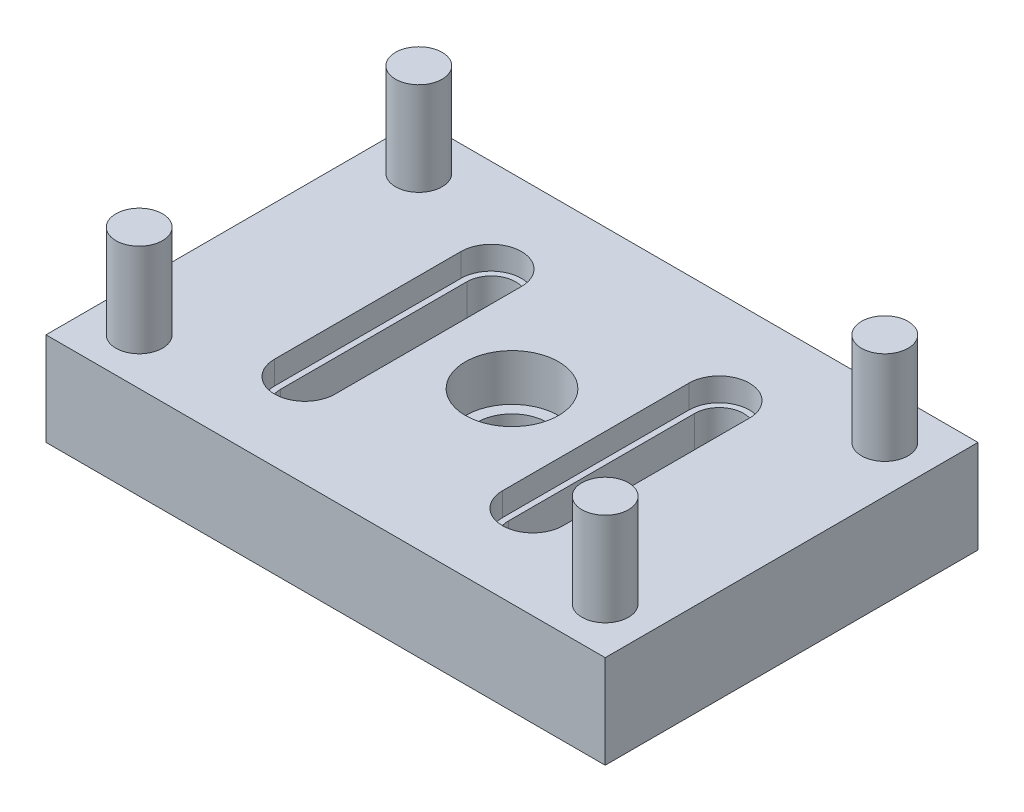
ISO-10303-21;
HEADER;
FILE_DESCRIPTION(('STEP AP214'),'2;1');
FILE_NAME('part.step','',(''),(''),'','','');
FILE_SCHEMA(('AUTOMOTIVE_DESIGN { 1 0 10303 214 1 1 1 1 }'));
ENDSEC;
DATA;
#1=APPLICATION_CONTEXT('core data for automotive mechanical design processes');
#2=APPLICATION_PROTOCOL_DEFINITION('international standard','automotive_design',2000,#1);
#3=PRODUCT_CONTEXT('',#1,'mechanical');
#4=PRODUCT('Part','Part','',(#3));
#5=PRODUCT_RELATED_PRODUCT_CATEGORY('part','',(#4));
#6=PRODUCT_DEFINITION_FORMATION('','',#4);
#7=PRODUCT_DEFINITION_CONTEXT('part definition',#1,'design');
#8=PRODUCT_DEFINITION('design','',#6,#7);
#9=PRODUCT_DEFINITION_SHAPE('','',#8);
#10=(LENGTH_UNIT() NAMED_UNIT(*) SI_UNIT(.MILLI.,.METRE.));
#11=(NAMED_UNIT(*) PLANE_ANGLE_UNIT() SI_UNIT($,.RADIAN.));
#12=(NAMED_UNIT(*) SI_UNIT($,.STERADIAN.) SOLID_ANGLE_UNIT());
#13=UNCERTAINTY_MEASURE_WITH_UNIT(LENGTH_MEASURE(1.E-05),#10,'distance_accuracy_value','');
#14=(GEOMETRIC_REPRESENTATION_CONTEXT(3) GLOBAL_UNCERTAINTY_ASSIGNED_CONTEXT((#13)) GLOBAL_UNIT_ASSIGNED_CONTEXT((#10,
#11,#12)) REPRESENTATION_CONTEXT('',''));
#15=CARTESIAN_POINT('',(0.,0.,0.));
#16=DIRECTION('',(0.,0.,1.));
#17=DIRECTION('',(1.,0.,0.));
#18=AXIS2_PLACEMENT_3D('',#15,#16,#17);
#19=CARTESIAN_POINT('',(0.,-25.4,0.));
#20=DIRECTION('',(0.,1.,0.));
#21=DIRECTION('',(0.,0.,1.));
#22=AXIS2_PLACEMENT_3D('',#19,#20,#21);
#23=CYLINDRICAL_SURFACE('',#22,9.525);
#24=CARTESIAN_POINT('',(0.,-25.4,0.));
#25=DIRECTION('',(0.,1.,0.));
#26=DIRECTION('',(0.,0.,1.));
#27=AXIS2_PLACEMENT_3D('',#24,#25,#26);
#28=CIRCLE('',#27,9.525);
#29=CARTESIAN_POINT('',(0.,-25.4,9.525));
#30=VERTEX_POINT('',#29);
#31=EDGE_CURVE('E352',#30,#30,#28,.T.);
#32=ORIENTED_EDGE('',*,*,#31,.F.);
#33=EDGE_LOOP('',(#32));
#34=FACE_BOUND('',#33,.T.);
#35=CARTESIAN_POINT('',(0.,-12.7,0.));
#36=DIRECTION('',(0.,1.,0.));
#37=DIRECTION('',(0.,0.,1.));
#38=AXIS2_PLACEMENT_3D('',#35,#36,#37);
#39=CIRCLE('',#38,9.525);
#40=CARTESIAN_POINT('',(0.,-12.7,9.525));
#41=VERTEX_POINT('',#40);
#42=EDGE_CURVE('E743',#41,#41,#39,.T.);
#43=ORIENTED_EDGE('',*,*,#42,.T.);
#44=EDGE_LOOP('',(#43));
#45=FACE_BOUND('',#44,.T.);
#46=ADVANCED_FACE('F33',(#34,#45),#23,.F.);
#47=CARTESIAN_POINT('',(-76.2,0.,50.8));
#48=DIRECTION('',(0.,1.,0.));
#49=DIRECTION('',(1.,0.,0.));
#50=AXIS2_PLACEMENT_3D('',#47,#48,#49);
#51=PLANE('',#50);
#52=CARTESIAN_POINT('',(0.,0.,0.));
#53=DIRECTION('',(0.,1.,0.));
#54=DIRECTION('',(0.,0.,1.));
#55=AXIS2_PLACEMENT_3D('',#52,#53,#54);
#56=CIRCLE('',#55,12.7);
#57=CARTESIAN_POINT('',(0.,0.,12.7));
#58=VERTEX_POINT('',#57);
#59=EDGE_CURVE('E749',#58,#58,#56,.T.);
#60=ORIENTED_EDGE('',*,*,#59,.F.);
#61=EDGE_LOOP('',(#60));
#62=FACE_BOUND('',#61,.T.);
#63=CARTESIAN_POINT('',(63.5,0.,38.1));
#64=DIRECTION('',(0.,1.,0.));
#65=DIRECTION('',(0.,0.,1.));
#66=AXIS2_PLACEMENT_3D('',#63,#64,#65);
#67=CIRCLE('',#66,6.35000000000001);
#68=CARTESIAN_POINT('',(63.5,0.,44.45));
#69=VERTEX_POINT('',#68);
#70=EDGE_CURVE('E11',#69,#69,#67,.T.);
#71=ORIENTED_EDGE('',*,*,#70,.F.);
#72=EDGE_LOOP('',(#71));
#73=FACE_BOUND('',#72,.T.);
#74=CARTESIAN_POINT('',(-63.5,0.,38.1));
#75=DIRECTION('',(0.,1.,0.));
#76=DIRECTION('',(0.,0.,1.));
#77=AXIS2_PLACEMENT_3D('',#74,#75,#76);
#78=CIRCLE('',#77,6.35);
#79=CARTESIAN_POINT('',(-63.5,0.,44.45));
#80=VERTEX_POINT('',#79);
#81=EDGE_CURVE('E358',#80,#80,#78,.T.);
#82=ORIENTED_EDGE('',*,*,#81,.F.);
#83=EDGE_LOOP('',(#82));
#84=FACE_BOUND('',#83,.T.);
#85=DIRECTION('',(0.,0.,1.));
#86=VECTOR('',#85,1.);
#87=CARTESIAN_POINT('',(-76.2,0.,-50.8));
#88=LINE('',#87,#86);
#89=CARTESIAN_POINT('',(-76.2,0.,-50.8));
#90=VERTEX_POINT('',#89);
#91=CARTESIAN_POINT('',(-76.2,0.,50.8));
#92=VERTEX_POINT('',#91);
#93=EDGE_CURVE('E295',#90,#92,#88,.T.);
#94=ORIENTED_EDGE('',*,*,#93,.T.);
#95=DIRECTION('',(1.,0.,0.));
#96=VECTOR('',#95,1.);
#97=CARTESIAN_POINT('',(-76.2,0.,50.8));
#98=LINE('',#97,#96);
#99=CARTESIAN_POINT('',(76.2,0.,50.8));
#100=VERTEX_POINT('',#99);
#101=EDGE_CURVE('E306',#92,#100,#98,.T.);
#102=ORIENTED_EDGE('',*,*,#101,.T.);
#103=DIRECTION('',(0.,0.,1.));
#104=VECTOR('',#103,1.);
#105=CARTESIAN_POINT('',(76.2,0.,-50.8));
#106=LINE('',#105,#104);
#107=CARTESIAN_POINT('',(76.2,0.,-50.8));
#108=VERTEX_POINT('',#107);
#109=EDGE_CURVE('E309',#108,#100,#106,.T.);
#110=ORIENTED_EDGE('',*,*,#109,.F.);
#111=DIRECTION('',(1.,0.,0.));
#112=VECTOR('',#111,1.);
#113=CARTESIAN_POINT('',(-76.2,0.,-50.8));
#114=LINE('',#113,#112);
#115=EDGE_CURVE('E312',#90,#108,#114,.T.);
#116=ORIENTED_EDGE('',*,*,#115,.F.);
#117=EDGE_LOOP('',(#94,#102,#110,#116));
#118=FACE_BOUND('',#117,.T.);
#119=DIRECTION('',(0.,0.,1.));
#120=VECTOR('',#119,1.);
#121=CARTESIAN_POINT('',(22.8092,0.,0.));
#122=LINE('',#121,#120);
#123=CARTESIAN_POINT('',(22.8092,0.,-25.4));
#124=VERTEX_POINT('',#123);
#125=CARTESIAN_POINT('',(22.8092,0.,25.4));
#126=VERTEX_POINT('',#125);
#127=EDGE_CURVE('E215',#124,#126,#122,.T.);
#128=ORIENTED_EDGE('',*,*,#127,.F.);
#129=CARTESIAN_POINT('',(31.0642,0.,-25.4));
#130=DIRECTION('',(0.,1.,0.));
#131=DIRECTION('',(0.,0.,1.));
#132=AXIS2_PLACEMENT_3D('',#129,#130,#131);
#133=CIRCLE('',#132,8.255);
#134=CARTESIAN_POINT('',(39.3192,0.,-25.4));
#135=VERTEX_POINT('',#134);
#136=EDGE_CURVE('E225',#124,#135,#133,.F.);
#137=ORIENTED_EDGE('',*,*,#136,.T.);
#138=DIRECTION('',(0.,0.,-1.));
#139=VECTOR('',#138,1.);
#140=CARTESIAN_POINT('',(39.3192,0.,0.));
#141=LINE('',#140,#139);
#142=CARTESIAN_POINT('',(39.3192,0.,25.4));
#143=VERTEX_POINT('',#142);
#144=EDGE_CURVE('E222',#143,#135,#141,.T.);
#145=ORIENTED_EDGE('',*,*,#144,.F.);
#146=CARTESIAN_POINT('',(31.0642,0.,25.4));
#147=DIRECTION('',(0.,1.,0.));
#148=DIRECTION('',(0.,0.,1.));
#149=AXIS2_PLACEMENT_3D('',#146,#147,#148);
#150=CIRCLE('',#149,8.255);
#151=EDGE_CURVE('E219',#126,#143,#150,.T.);
#152=ORIENTED_EDGE('',*,*,#151,.F.);
#153=EDGE_LOOP('',(#128,#137,#145,#152));
#154=FACE_BOUND('',#153,.T.);
#155=DIRECTION('',(0.,0.,1.));
#156=VECTOR('',#155,1.);
#157=CARTESIAN_POINT('',(-22.8092,0.,0.));
#158=LINE('',#157,#156);
#159=CARTESIAN_POINT('',(-22.8092,0.,-25.4));
#160=VERTEX_POINT('',#159);
#161=CARTESIAN_POINT('',(-22.8092,0.,25.4));
#162=VERTEX_POINT('',#161);
#163=EDGE_CURVE('E187',#160,#162,#158,.T.);
#164=ORIENTED_EDGE('',*,*,#163,.T.);
#165=CARTESIAN_POINT('',(-31.0642,0.,25.4));
#166=DIRECTION('',(0.,1.,0.));
#167=DIRECTION('',(0.,0.,1.));
#168=AXIS2_PLACEMENT_3D('',#165,#166,#167);
#169=CIRCLE('',#168,8.255);
#170=CARTESIAN_POINT('',(-39.3192,0.,25.4));
#171=VERTEX_POINT('',#170);
#172=EDGE_CURVE('E48',#162,#171,#169,.F.);
#173=ORIENTED_EDGE('',*,*,#172,.T.);
#174=DIRECTION('',(0.,0.,-1.));
#175=VECTOR('',#174,1.);
#176=CARTESIAN_POINT('',(-39.3192,0.,0.));
#177=LINE('',#176,#175);
#178=CARTESIAN_POINT('',(-39.3192,0.,-25.4));
#179=VERTEX_POINT('',#178);
#180=EDGE_CURVE('E193',#171,#179,#177,.T.);
#181=ORIENTED_EDGE('',*,*,#180,.T.);
#182=CARTESIAN_POINT('',(-31.0642,0.,-25.4));
#183=DIRECTION('',(0.,1.,0.));
#184=DIRECTION('',(0.,0.,1.));
#185=AXIS2_PLACEMENT_3D('',#182,#183,#184);
#186=CIRCLE('',#185,8.255);
#187=EDGE_CURVE('E177',#160,#179,#186,.T.);
#188=ORIENTED_EDGE('',*,*,#187,.F.);
#189=EDGE_LOOP('',(#164,#173,#181,#188));
#190=FACE_BOUND('',#189,.T.);
#191=CARTESIAN_POINT('',(-63.5,0.,-38.1));
#192=DIRECTION('',(0.,1.,0.));
#193=DIRECTION('',(0.,0.,1.));
#194=AXIS2_PLACEMENT_3D('',#191,#192,#193);
#195=CIRCLE('',#194,6.35);
#196=CARTESIAN_POINT('',(-63.5,0.,-31.75));
#197=VERTEX_POINT('',#196);
#198=EDGE_CURVE('E41',#197,#197,#195,.T.);
#199=ORIENTED_EDGE('',*,*,#198,.F.);
#200=EDGE_LOOP('',(#199));
#201=FACE_BOUND('',#200,.T.);
#202=CARTESIAN_POINT('',(63.5,0.,-38.1));
#203=DIRECTION('',(0.,1.,0.));
#204=DIRECTION('',(0.,0.,1.));
#205=AXIS2_PLACEMENT_3D('',#202,#203,#204);
#206=CIRCLE('',#205,6.35000000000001);
#207=CARTESIAN_POINT('',(63.5,0.,-31.75));
#208=VERTEX_POINT('',#207);
#209=EDGE_CURVE('E343',#208,#208,#206,.T.);
#210=ORIENTED_EDGE('',*,*,#209,.F.);
#211=EDGE_LOOP('',(#210));
#212=FACE_BOUND('',#211,.T.);
#213=ADVANCED_FACE('F191',(#62,#73,#84,#118,#154,#190,#201,#212),#51,.T.);
#214=CARTESIAN_POINT('',(-31.0642,-25.4,25.4));
#215=DIRECTION('',(0.,1.,0.));
#216=DIRECTION('',(0.,0.,1.));
#217=AXIS2_PLACEMENT_3D('',#214,#215,#216);
#218=CYLINDRICAL_SURFACE('',#217,6.6675);
#219=DIRECTION('',(0.,1.,0.));
#220=VECTOR('',#219,1.);
#221=CARTESIAN_POINT('',(-37.7317,-25.4,25.4));
#222=LINE('',#221,#220);
#223=CARTESIAN_POINT('',(-37.7317,-25.4,25.4));
#224=VERTEX_POINT('',#223);
#225=CARTESIAN_POINT('',(-37.7317,-6.35,25.4));
#226=VERTEX_POINT('',#225);
#227=EDGE_CURVE('E292',#224,#226,#222,.T.);
#228=ORIENTED_EDGE('',*,*,#227,.T.);
#229=CARTESIAN_POINT('',(-31.0642,-6.35,25.4));
#230=DIRECTION('',(0.,1.,0.));
#231=DIRECTION('',(0.,0.,1.));
#232=AXIS2_PLACEMENT_3D('',#229,#230,#231);
#233=CIRCLE('',#232,6.6675);
#234=CARTESIAN_POINT('',(-24.3967,-6.35,25.4));
#235=VERTEX_POINT('',#234);
#236=EDGE_CURVE('E208',#235,#226,#233,.F.);
#237=ORIENTED_EDGE('',*,*,#236,.F.);
#238=DIRECTION('',(0.,1.,0.));
#239=VECTOR('',#238,1.);
#240=CARTESIAN_POINT('',(-24.3967,-25.4,25.4));
#241=LINE('',#240,#239);
#242=CARTESIAN_POINT('',(-24.3967,-25.4,25.4));
#243=VERTEX_POINT('',#242);
#244=EDGE_CURVE('E291',#243,#235,#241,.T.);
#245=ORIENTED_EDGE('',*,*,#244,.F.);
#246=CARTESIAN_POINT('',(-31.0642,-25.4,25.4));
#247=DIRECTION('',(0.,1.,0.));
#248=DIRECTION('',(0.,0.,1.));
#249=AXIS2_PLACEMENT_3D('',#246,#247,#248);
#250=CIRCLE('',#249,6.6675);
#251=EDGE_CURVE('E274',#243,#224,#250,.F.);
#252=ORIENTED_EDGE('',*,*,#251,.T.);
#253=EDGE_LOOP('',(#228,#237,#245,#252));
#254=FACE_BOUND('',#253,.T.);
#255=ADVANCED_FACE('F338',(#254),#218,.F.);
#256=CARTESIAN_POINT('',(-37.7317,-25.4,0.));
#257=DIRECTION('',(1.,0.,0.));
#258=DIRECTION('',(0.,0.,-1.));
#259=AXIS2_PLACEMENT_3D('',#256,#257,#258);
#260=PLANE('',#259);
#261=DIRECTION('',(0.,1.,0.));
#262=VECTOR('',#261,1.);
#263=CARTESIAN_POINT('',(-37.7317,-25.4,-25.4));
#264=LINE('',#263,#262);
#265=CARTESIAN_POINT('',(-37.7317,-25.4,-25.4));
#266=VERTEX_POINT('',#265);
#267=CARTESIAN_POINT('',(-37.7317,-6.35,-25.4));
#268=VERTEX_POINT('',#267);
#269=EDGE_CURVE('E296',#266,#268,#264,.T.);
#270=ORIENTED_EDGE('',*,*,#269,.T.);
#271=DIRECTION('',(0.,0.,-1.));
#272=VECTOR('',#271,1.);
#273=CARTESIAN_POINT('',(-37.7317,-6.35,0.));
#274=LINE('',#273,#272);
#275=EDGE_CURVE('E210',#226,#268,#274,.T.);
#276=ORIENTED_EDGE('',*,*,#275,.F.);
#277=ORIENTED_EDGE('',*,*,#227,.F.);
#278=DIRECTION('',(0.,0.,-1.));
#279=VECTOR('',#278,1.);
#280=CARTESIAN_POINT('',(-37.7317,-25.4,0.));
#281=LINE('',#280,#279);
#282=EDGE_CURVE('E289',#224,#266,#281,.T.);
#283=ORIENTED_EDGE('',*,*,#282,.T.);
#284=EDGE_LOOP('',(#270,#276,#277,#283));
#285=FACE_BOUND('',#284,.T.);
#286=ADVANCED_FACE('F489',(#285),#260,.T.);
#287=CARTESIAN_POINT('',(-31.0642,-25.4,-25.4));
#288=DIRECTION('',(0.,1.,0.));
#289=DIRECTION('',(0.,0.,1.));
#290=AXIS2_PLACEMENT_3D('',#287,#288,#289);
#291=CYLINDRICAL_SURFACE('',#290,6.6675);
#292=CARTESIAN_POINT('',(-31.0642,-6.35,-25.4));
#293=DIRECTION('',(0.,1.,0.));
#294=DIRECTION('',(0.,0.,1.));
#295=AXIS2_PLACEMENT_3D('',#292,#293,#294);
#296=CIRCLE('',#295,6.6675);
#297=CARTESIAN_POINT('',(-24.3967,-6.35,-25.4));
#298=VERTEX_POINT('',#297);
#299=EDGE_CURVE('E56',#298,#268,#296,.T.);
#300=ORIENTED_EDGE('',*,*,#299,.T.);
#301=ORIENTED_EDGE('',*,*,#269,.F.);
#302=CARTESIAN_POINT('',(-31.0642,-25.4,-25.4));
#303=DIRECTION('',(0.,1.,0.));
#304=DIRECTION('',(0.,0.,1.));
#305=AXIS2_PLACEMENT_3D('',#302,#303,#304);
#306=CIRCLE('',#305,6.6675);
#307=CARTESIAN_POINT('',(-24.3967,-25.4,-25.4));
#308=VERTEX_POINT('',#307);
#309=EDGE_CURVE('E286',#308,#266,#306,.T.);
#310=ORIENTED_EDGE('',*,*,#309,.F.);
#311=DIRECTION('',(0.,1.,0.));
#312=VECTOR('',#311,1.);
#313=CARTESIAN_POINT('',(-24.3967,-25.4,-25.4));
#314=LINE('',#313,#312);
#315=EDGE_CURVE('E299',#308,#298,#314,.T.);
#316=ORIENTED_EDGE('',*,*,#315,.T.);
#317=EDGE_LOOP('',(#300,#301,#310,#316));
#318=FACE_BOUND('',#317,.T.);
#319=ADVANCED_FACE('F492',(#318),#291,.F.);
#320=CARTESIAN_POINT('',(-24.3967,-25.4,0.));
#321=DIRECTION('',(-1.,0.,0.));
#322=DIRECTION('',(0.,0.,1.));
#323=AXIS2_PLACEMENT_3D('',#320,#321,#322);
#324=PLANE('',#323);
#325=ORIENTED_EDGE('',*,*,#244,.T.);
#326=DIRECTION('',(0.,0.,1.));
#327=VECTOR('',#326,1.);
#328=CARTESIAN_POINT('',(-24.3967,-6.35,0.));
#329=LINE('',#328,#327);
#330=EDGE_CURVE('E206',#298,#235,#329,.T.);
#331=ORIENTED_EDGE('',*,*,#330,.F.);
#332=ORIENTED_EDGE('',*,*,#315,.F.);
#333=DIRECTION('',(0.,0.,1.));
#334=VECTOR('',#333,1.);
#335=CARTESIAN_POINT('',(-24.3967,-25.4,0.));
#336=LINE('',#335,#334);
#337=EDGE_CURVE('E284',#308,#243,#336,.T.);
#338=ORIENTED_EDGE('',*,*,#337,.T.);
#339=EDGE_LOOP('',(#325,#331,#332,#338));
#340=FACE_BOUND('',#339,.T.);
#341=ADVANCED_FACE('F488',(#340),#324,.T.);
#342=CARTESIAN_POINT('',(24.3967,-25.4,0.));
#343=DIRECTION('',(-1.,0.,0.));
#344=DIRECTION('',(0.,0.,1.));
#345=AXIS2_PLACEMENT_3D('',#342,#343,#344);
#346=PLANE('',#345);
#347=DIRECTION('',(0.,0.,1.));
#348=VECTOR('',#347,1.);
#349=CARTESIAN_POINT('',(24.3967,-6.35,0.));
#350=LINE('',#349,#348);
#351=CARTESIAN_POINT('',(24.3967,-6.35,-25.4));
#352=VERTEX_POINT('',#351);
#353=CARTESIAN_POINT('',(24.3967,-6.35,25.4));
#354=VERTEX_POINT('',#353);
#355=EDGE_CURVE('E231',#352,#354,#350,.T.);
#356=ORIENTED_EDGE('',*,*,#355,.T.);
#357=DIRECTION('',(0.,1.,0.));
#358=VECTOR('',#357,1.);
#359=CARTESIAN_POINT('',(24.3967,-25.4,25.4));
#360=LINE('',#359,#358);
#361=CARTESIAN_POINT('',(24.3967,-25.4,25.4));
#362=VERTEX_POINT('',#361);
#363=EDGE_CURVE('E270',#362,#354,#360,.T.);
#364=ORIENTED_EDGE('',*,*,#363,.F.);
#365=DIRECTION('',(0.,0.,1.));
#366=VECTOR('',#365,1.);
#367=CARTESIAN_POINT('',(24.3967,-25.4,0.));
#368=LINE('',#367,#366);
#369=CARTESIAN_POINT('',(24.3967,-25.4,-25.4));
#370=VERTEX_POINT('',#369);
#371=EDGE_CURVE('E253',#370,#362,#368,.T.);
#372=ORIENTED_EDGE('',*,*,#371,.F.);
#373=DIRECTION('',(0.,1.,0.));
#374=VECTOR('',#373,1.);
#375=CARTESIAN_POINT('',(24.3967,-25.4,-25.4));
#376=LINE('',#375,#374);
#377=EDGE_CURVE('E271',#370,#352,#376,.T.);
#378=ORIENTED_EDGE('',*,*,#377,.T.);
#379=EDGE_LOOP('',(#356,#364,#372,#378));
#380=FACE_BOUND('',#379,.T.);
#381=ADVANCED_FACE('F463',(#380),#346,.F.);
#382=CARTESIAN_POINT('',(31.0642,-25.4,-25.4));
#383=DIRECTION('',(0.,1.,0.));
#384=DIRECTION('',(0.,0.,1.));
#385=AXIS2_PLACEMENT_3D('',#382,#383,#384);
#386=CYLINDRICAL_SURFACE('',#385,6.6675);
#387=DIRECTION('',(0.,1.,0.));
#388=VECTOR('',#387,1.);
#389=CARTESIAN_POINT('',(37.7317,-25.4,-25.4));
#390=LINE('',#389,#388);
#391=CARTESIAN_POINT('',(37.7317,-25.4,-25.4));
#392=VERTEX_POINT('',#391);
#393=CARTESIAN_POINT('',(37.7317,-6.35,-25.4));
#394=VERTEX_POINT('',#393);
#395=EDGE_CURVE('E275',#392,#394,#390,.T.);
#396=ORIENTED_EDGE('',*,*,#395,.T.);
#397=CARTESIAN_POINT('',(31.0642,-6.35,-25.4));
#398=DIRECTION('',(0.,1.,0.));
#399=DIRECTION('',(0.,0.,1.));
#400=AXIS2_PLACEMENT_3D('',#397,#398,#399);
#401=CIRCLE('',#400,6.6675);
#402=EDGE_CURVE('E234',#352,#394,#401,.F.);
#403=ORIENTED_EDGE('',*,*,#402,.F.);
#404=ORIENTED_EDGE('',*,*,#377,.F.);
#405=CARTESIAN_POINT('',(31.0642,-25.4,-25.4));
#406=DIRECTION('',(0.,1.,0.));
#407=DIRECTION('',(0.,0.,1.));
#408=AXIS2_PLACEMENT_3D('',#405,#406,#407);
#409=CIRCLE('',#408,6.6675);
#410=EDGE_CURVE('E268',#370,#392,#409,.F.);
#411=ORIENTED_EDGE('',*,*,#410,.T.);
#412=EDGE_LOOP('',(#396,#403,#404,#411));
#413=FACE_BOUND('',#412,.T.);
#414=ADVANCED_FACE('F473',(#413),#386,.F.);
#415=CARTESIAN_POINT('',(37.7317,-25.4,0.));
#416=DIRECTION('',(1.,0.,0.));
#417=DIRECTION('',(0.,0.,-1.));
#418=AXIS2_PLACEMENT_3D('',#415,#416,#417);
#419=PLANE('',#418);
#420=DIRECTION('',(0.,0.,-1.));
#421=VECTOR('',#420,1.);
#422=CARTESIAN_POINT('',(37.7317,-6.35,0.));
#423=LINE('',#422,#421);
#424=CARTESIAN_POINT('',(37.7317,-6.35,25.4));
#425=VERTEX_POINT('',#424);
#426=EDGE_CURVE('E236',#425,#394,#423,.T.);
#427=ORIENTED_EDGE('',*,*,#426,.T.);
#428=ORIENTED_EDGE('',*,*,#395,.F.);
#429=DIRECTION('',(0.,0.,-1.));
#430=VECTOR('',#429,1.);
#431=CARTESIAN_POINT('',(37.7317,-25.4,0.));
#432=LINE('',#431,#430);
#433=CARTESIAN_POINT('',(37.7317,-25.4,25.4));
#434=VERTEX_POINT('',#433);
#435=EDGE_CURVE('E265',#434,#392,#432,.T.);
#436=ORIENTED_EDGE('',*,*,#435,.F.);
#437=DIRECTION('',(0.,1.,0.));
#438=VECTOR('',#437,1.);
#439=CARTESIAN_POINT('',(37.7317,-25.4,25.4));
#440=LINE('',#439,#438);
#441=EDGE_CURVE('E278',#434,#425,#440,.T.);
#442=ORIENTED_EDGE('',*,*,#441,.T.);
#443=EDGE_LOOP('',(#427,#428,#436,#442));
#444=FACE_BOUND('',#443,.T.);
#445=ADVANCED_FACE('F475',(#444),#419,.F.);
#446=CARTESIAN_POINT('',(31.0642,-25.4,25.4));
#447=DIRECTION('',(0.,1.,0.));
#448=DIRECTION('',(0.,0.,1.));
#449=AXIS2_PLACEMENT_3D('',#446,#447,#448);
#450=CYLINDRICAL_SURFACE('',#449,6.6675);
#451=CARTESIAN_POINT('',(31.0642,-6.35,25.4));
#452=DIRECTION('',(0.,1.,0.));
#453=DIRECTION('',(0.,0.,1.));
#454=AXIS2_PLACEMENT_3D('',#451,#452,#453);
#455=CIRCLE('',#454,6.6675);
#456=EDGE_CURVE('E228',#354,#425,#455,.T.);
#457=ORIENTED_EDGE('',*,*,#456,.T.);
#458=ORIENTED_EDGE('',*,*,#441,.F.);
#459=CARTESIAN_POINT('',(31.0642,-25.4,25.4));
#460=DIRECTION('',(0.,1.,0.));
#461=DIRECTION('',(0.,0.,1.));
#462=AXIS2_PLACEMENT_3D('',#459,#460,#461);
#463=CIRCLE('',#462,6.6675);
#464=EDGE_CURVE('E262',#362,#434,#463,.T.);
#465=ORIENTED_EDGE('',*,*,#464,.F.);
#466=ORIENTED_EDGE('',*,*,#363,.T.);
#467=EDGE_LOOP('',(#457,#458,#465,#466));
#468=FACE_BOUND('',#467,.T.);
#469=ADVANCED_FACE('F466',(#468),#450,.F.);
#470=CARTESIAN_POINT('',(-76.2,-25.4,50.8));
#471=DIRECTION('',(0.,1.,0.));
#472=DIRECTION('',(1.,0.,0.));
#473=AXIS2_PLACEMENT_3D('',#470,#471,#472);
#474=PLANE('',#473);
#475=ORIENTED_EDGE('',*,*,#31,.T.);
#476=EDGE_LOOP('',(#475));
#477=FACE_BOUND('',#476,.T.);
#478=ORIENTED_EDGE('',*,*,#410,.F.);
#479=ORIENTED_EDGE('',*,*,#371,.T.);
#480=ORIENTED_EDGE('',*,*,#464,.T.);
#481=ORIENTED_EDGE('',*,*,#435,.T.);
#482=EDGE_LOOP('',(#478,#479,#480,#481));
#483=FACE_BOUND('',#482,.T.);
#484=DIRECTION('',(0.,0.,1.));
#485=VECTOR('',#484,1.);
#486=CARTESIAN_POINT('',(-76.2,-25.4,-50.8));
#487=LINE('',#486,#485);
#488=CARTESIAN_POINT('',(-76.2,-25.4,-50.8));
#489=VERTEX_POINT('',#488);
#490=CARTESIAN_POINT('',(-76.2,-25.4,50.8));
#491=VERTEX_POINT('',#490);
#492=EDGE_CURVE('E314',#489,#491,#487,.T.);
#493=ORIENTED_EDGE('',*,*,#492,.F.);
#494=DIRECTION('',(1.,0.,0.));
#495=VECTOR('',#494,1.);
#496=CARTESIAN_POINT('',(-76.2,-25.4,-50.8));
#497=LINE('',#496,#495);
#498=CARTESIAN_POINT('',(76.2,-25.4,-50.8));
#499=VERTEX_POINT('',#498);
#500=EDGE_CURVE('E322',#489,#499,#497,.T.);
#501=ORIENTED_EDGE('',*,*,#500,.T.);
#502=DIRECTION('',(0.,0.,1.));
#503=VECTOR('',#502,1.);
#504=CARTESIAN_POINT('',(76.2,-25.4,-50.8));
#505=LINE('',#504,#503);
#506=CARTESIAN_POINT('',(76.2,-25.4,50.8));
#507=VERTEX_POINT('',#506);
#508=EDGE_CURVE('E320',#499,#507,#505,.T.);
#509=ORIENTED_EDGE('',*,*,#508,.T.);
#510=DIRECTION('',(1.,0.,0.));
#511=VECTOR('',#510,1.);
#512=CARTESIAN_POINT('',(-76.2,-25.4,50.8));
#513=LINE('',#512,#511);
#514=EDGE_CURVE('E317',#491,#507,#513,.T.);
#515=ORIENTED_EDGE('',*,*,#514,.F.);
#516=EDGE_LOOP('',(#493,#501,#509,#515));
#517=FACE_BOUND('',#516,.T.);
#518=ORIENTED_EDGE('',*,*,#251,.F.);
#519=ORIENTED_EDGE('',*,*,#337,.F.);
#520=ORIENTED_EDGE('',*,*,#309,.T.);
#521=ORIENTED_EDGE('',*,*,#282,.F.);
#522=EDGE_LOOP('',(#518,#519,#520,#521));
#523=FACE_BOUND('',#522,.T.);
#524=ADVANCED_FACE('F469',(#477,#483,#517,#523),#474,.F.);
#525=CARTESIAN_POINT('',(-76.2,-25.4,-50.8));
#526=DIRECTION('',(-1.,0.,0.));
#527=DIRECTION('',(0.,0.,1.));
#528=AXIS2_PLACEMENT_3D('',#525,#526,#527);
#529=PLANE('',#528);
#530=ORIENTED_EDGE('',*,*,#93,.F.);
#531=DIRECTION('',(0.,1.,0.));
#532=VECTOR('',#531,1.);
#533=CARTESIAN_POINT('',(-76.2,-25.4,-50.8));
#534=LINE('',#533,#532);
#535=EDGE_CURVE('E325',#489,#90,#534,.T.);
#536=ORIENTED_EDGE('',*,*,#535,.F.);
#537=ORIENTED_EDGE('',*,*,#492,.T.);
#538=DIRECTION('',(0.,1.,0.));
#539=VECTOR('',#538,1.);
#540=CARTESIAN_POINT('',(-76.2,-25.4,50.8));
#541=LINE('',#540,#539);
#542=EDGE_CURVE('E324',#491,#92,#541,.T.);
#543=ORIENTED_EDGE('',*,*,#542,.T.);
#544=EDGE_LOOP('',(#530,#536,#537,#543));
#545=FACE_BOUND('',#544,.T.);
#546=ADVANCED_FACE('F35',(#545),#529,.T.);
#547=CARTESIAN_POINT('',(-76.2,-25.4,-50.8));
#548=DIRECTION('',(0.,0.,1.));
#549=DIRECTION('',(1.,0.,0.));
#550=AXIS2_PLACEMENT_3D('',#547,#548,#549);
#551=PLANE('',#550);
#552=ORIENTED_EDGE('',*,*,#115,.T.);
#553=DIRECTION('',(0.,1.,0.));
#554=VECTOR('',#553,1.);
#555=CARTESIAN_POINT('',(76.2,-25.4,-50.8));
#556=LINE('',#555,#554);
#557=EDGE_CURVE('E327',#499,#108,#556,.T.);
#558=ORIENTED_EDGE('',*,*,#557,.F.);
#559=ORIENTED_EDGE('',*,*,#500,.F.);
#560=ORIENTED_EDGE('',*,*,#535,.T.);
#561=EDGE_LOOP('',(#552,#558,#559,#560));
#562=FACE_BOUND('',#561,.T.);
#563=ADVANCED_FACE('F506',(#562),#551,.F.);
#564=CARTESIAN_POINT('',(76.2,-25.4,-50.8));
#565=DIRECTION('',(-1.,0.,0.));
#566=DIRECTION('',(0.,0.,1.));
#567=AXIS2_PLACEMENT_3D('',#564,#565,#566);
#568=PLANE('',#567);
#569=ORIENTED_EDGE('',*,*,#109,.T.);
#570=DIRECTION('',(0.,1.,0.));
#571=VECTOR('',#570,1.);
#572=CARTESIAN_POINT('',(76.2,-25.4,50.8));
#573=LINE('',#572,#571);
#574=EDGE_CURVE('E330',#507,#100,#573,.T.);
#575=ORIENTED_EDGE('',*,*,#574,.F.);
#576=ORIENTED_EDGE('',*,*,#508,.F.);
#577=ORIENTED_EDGE('',*,*,#557,.T.);
#578=EDGE_LOOP('',(#569,#575,#576,#577));
#579=FACE_BOUND('',#578,.T.);
#580=ADVANCED_FACE('F509',(#579),#568,.F.);
#581=CARTESIAN_POINT('',(-76.2,-25.4,50.8));
#582=DIRECTION('',(0.,0.,1.));
#583=DIRECTION('',(1.,0.,0.));
#584=AXIS2_PLACEMENT_3D('',#581,#582,#583);
#585=PLANE('',#584);
#586=ORIENTED_EDGE('',*,*,#101,.F.);
#587=ORIENTED_EDGE('',*,*,#542,.F.);
#588=ORIENTED_EDGE('',*,*,#514,.T.);
#589=ORIENTED_EDGE('',*,*,#574,.T.);
#590=EDGE_LOOP('',(#586,#587,#588,#589));
#591=FACE_BOUND('',#590,.T.);
#592=ADVANCED_FACE('F512',(#591),#585,.T.);
#593=CARTESIAN_POINT('',(22.8092,-6.35,0.));
#594=DIRECTION('',(-1.,0.,0.));
#595=DIRECTION('',(0.,0.,1.));
#596=AXIS2_PLACEMENT_3D('',#593,#594,#595);
#597=PLANE('',#596);
#598=ORIENTED_EDGE('',*,*,#127,.T.);
#599=DIRECTION('',(0.,1.,0.));
#600=VECTOR('',#599,1.);
#601=CARTESIAN_POINT('',(22.8092,-6.35,25.4));
#602=LINE('',#601,#600);
#603=CARTESIAN_POINT('',(22.8092,-6.35,25.4));
#604=VERTEX_POINT('',#603);
#605=EDGE_CURVE('E250',#604,#126,#602,.T.);
#606=ORIENTED_EDGE('',*,*,#605,.F.);
#607=DIRECTION('',(0.,0.,1.));
#608=VECTOR('',#607,1.);
#609=CARTESIAN_POINT('',(22.8092,-6.35,0.));
#610=LINE('',#609,#608);
#611=CARTESIAN_POINT('',(22.8092,-6.35,-25.4));
#612=VERTEX_POINT('',#611);
#613=EDGE_CURVE('E239',#612,#604,#610,.T.);
#614=ORIENTED_EDGE('',*,*,#613,.F.);
#615=DIRECTION('',(0.,1.,0.));
#616=VECTOR('',#615,1.);
#617=CARTESIAN_POINT('',(22.8092,-6.35,-25.4));
#618=LINE('',#617,#616);
#619=EDGE_CURVE('E251',#612,#124,#618,.T.);
#620=ORIENTED_EDGE('',*,*,#619,.T.);
#621=EDGE_LOOP('',(#598,#606,#614,#620));
#622=FACE_BOUND('',#621,.T.);
#623=ADVANCED_FACE('F383',(#622),#597,.F.);
#624=CARTESIAN_POINT('',(31.0642,-6.35,-25.4));
#625=DIRECTION('',(0.,1.,0.));
#626=DIRECTION('',(0.,0.,1.));
#627=AXIS2_PLACEMENT_3D('',#624,#625,#626);
#628=CYLINDRICAL_SURFACE('',#627,8.255);
#629=ORIENTED_EDGE('',*,*,#136,.F.);
#630=ORIENTED_EDGE('',*,*,#619,.F.);
#631=CARTESIAN_POINT('',(31.0642,-6.35,-25.4));
#632=DIRECTION('',(0.,1.,0.));
#633=DIRECTION('',(0.,0.,1.));
#634=AXIS2_PLACEMENT_3D('',#631,#632,#633);
#635=CIRCLE('',#634,8.255);
#636=CARTESIAN_POINT('',(39.3192,-6.35,-25.4));
#637=VERTEX_POINT('',#636);
#638=EDGE_CURVE('E248',#612,#637,#635,.F.);
#639=ORIENTED_EDGE('',*,*,#638,.T.);
#640=DIRECTION('',(0.,1.,0.));
#641=VECTOR('',#640,1.);
#642=CARTESIAN_POINT('',(39.3192,-6.35,-25.4));
#643=LINE('',#642,#641);
#644=EDGE_CURVE('E254',#637,#135,#643,.T.);
#645=ORIENTED_EDGE('',*,*,#644,.T.);
#646=EDGE_LOOP('',(#629,#630,#639,#645));
#647=FACE_BOUND('',#646,.T.);
#648=ADVANCED_FACE('F394',(#647),#628,.F.);
#649=CARTESIAN_POINT('',(39.3192,-6.35,0.));
#650=DIRECTION('',(1.,0.,0.));
#651=DIRECTION('',(0.,0.,-1.));
#652=AXIS2_PLACEMENT_3D('',#649,#650,#651);
#653=PLANE('',#652);
#654=ORIENTED_EDGE('',*,*,#144,.T.);
#655=ORIENTED_EDGE('',*,*,#644,.F.);
#656=DIRECTION('',(0.,0.,-1.));
#657=VECTOR('',#656,1.);
#658=CARTESIAN_POINT('',(39.3192,-6.35,0.));
#659=LINE('',#658,#657);
#660=CARTESIAN_POINT('',(39.3192,-6.35,25.4));
#661=VERTEX_POINT('',#660);
#662=EDGE_CURVE('E245',#661,#637,#659,.T.);
#663=ORIENTED_EDGE('',*,*,#662,.F.);
#664=DIRECTION('',(0.,1.,0.));
#665=VECTOR('',#664,1.);
#666=CARTESIAN_POINT('',(39.3192,-6.35,25.4));
#667=LINE('',#666,#665);
#668=EDGE_CURVE('E256',#661,#143,#667,.T.);
#669=ORIENTED_EDGE('',*,*,#668,.T.);
#670=EDGE_LOOP('',(#654,#655,#663,#669));
#671=FACE_BOUND('',#670,.T.);
#672=ADVANCED_FACE('F396',(#671),#653,.F.);
#673=CARTESIAN_POINT('',(31.0642,-6.35,25.4));
#674=DIRECTION('',(0.,1.,0.));
#675=DIRECTION('',(0.,0.,1.));
#676=AXIS2_PLACEMENT_3D('',#673,#674,#675);
#677=CYLINDRICAL_SURFACE('',#676,8.255);
#678=ORIENTED_EDGE('',*,*,#151,.T.);
#679=ORIENTED_EDGE('',*,*,#668,.F.);
#680=CARTESIAN_POINT('',(31.0642,-6.35,25.4));
#681=DIRECTION('',(0.,1.,0.));
#682=DIRECTION('',(0.,0.,1.));
#683=AXIS2_PLACEMENT_3D('',#680,#681,#682);
#684=CIRCLE('',#683,8.255);
#685=EDGE_CURVE('E242',#604,#661,#684,.T.);
#686=ORIENTED_EDGE('',*,*,#685,.F.);
#687=ORIENTED_EDGE('',*,*,#605,.T.);
#688=EDGE_LOOP('',(#678,#679,#686,#687));
#689=FACE_BOUND('',#688,.T.);
#690=ADVANCED_FACE('F387',(#689),#677,.F.);
#691=CARTESIAN_POINT('',(-142.60802656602,-6.35,0.));
#692=DIRECTION('',(0.,1.,0.));
#693=DIRECTION('',(0.,0.,1.));
#694=AXIS2_PLACEMENT_3D('',#691,#692,#693);
#695=PLANE('',#694);
#696=ORIENTED_EDGE('',*,*,#456,.F.);
#697=ORIENTED_EDGE('',*,*,#355,.F.);
#698=ORIENTED_EDGE('',*,*,#402,.T.);
#699=ORIENTED_EDGE('',*,*,#426,.F.);
#700=EDGE_LOOP('',(#696,#697,#698,#699));
#701=FACE_BOUND('',#700,.T.);
#702=ORIENTED_EDGE('',*,*,#613,.T.);
#703=ORIENTED_EDGE('',*,*,#685,.T.);
#704=ORIENTED_EDGE('',*,*,#662,.T.);
#705=ORIENTED_EDGE('',*,*,#638,.F.);
#706=EDGE_LOOP('',(#702,#703,#704,#705));
#707=FACE_BOUND('',#706,.T.);
#708=ADVANCED_FACE('F391',(#701,#707),#695,.T.);
#709=CARTESIAN_POINT('',(-31.0642,-6.35,25.4));
#710=DIRECTION('',(0.,1.,0.));
#711=DIRECTION('',(0.,0.,1.));
#712=AXIS2_PLACEMENT_3D('',#709,#710,#711);
#713=CYLINDRICAL_SURFACE('',#712,8.255);
#714=ORIENTED_EDGE('',*,*,#172,.F.);
#715=DIRECTION('',(0.,1.,0.));
#716=VECTOR('',#715,1.);
#717=CARTESIAN_POINT('',(-22.8092,-6.35,25.4));
#718=LINE('',#717,#716);
#719=CARTESIAN_POINT('',(-22.8092,-6.35,25.4));
#720=VERTEX_POINT('',#719);
#721=EDGE_CURVE('E184',#720,#162,#718,.T.);
#722=ORIENTED_EDGE('',*,*,#721,.F.);
#723=CARTESIAN_POINT('',(-31.0642,-6.35,25.4));
#724=DIRECTION('',(0.,1.,0.));
#725=DIRECTION('',(0.,0.,1.));
#726=AXIS2_PLACEMENT_3D('',#723,#724,#725);
#727=CIRCLE('',#726,8.255);
#728=CARTESIAN_POINT('',(-39.3192,-6.35,25.4));
#729=VERTEX_POINT('',#728);
#730=EDGE_CURVE('E195',#720,#729,#727,.F.);
#731=ORIENTED_EDGE('',*,*,#730,.T.);
#732=DIRECTION('',(0.,1.,0.));
#733=VECTOR('',#732,1.);
#734=CARTESIAN_POINT('',(-39.3192,-6.35,25.4));
#735=LINE('',#734,#733);
#736=EDGE_CURVE('E213',#729,#171,#735,.T.);
#737=ORIENTED_EDGE('',*,*,#736,.T.);
#738=EDGE_LOOP('',(#714,#722,#731,#737));
#739=FACE_BOUND('',#738,.T.);
#740=ADVANCED_FACE('F447',(#739),#713,.F.);
#741=CARTESIAN_POINT('',(-39.3192,-6.35,0.));
#742=DIRECTION('',(1.,0.,0.));
#743=DIRECTION('',(0.,0.,-1.));
#744=AXIS2_PLACEMENT_3D('',#741,#742,#743);
#745=PLANE('',#744);
#746=ORIENTED_EDGE('',*,*,#180,.F.);
#747=ORIENTED_EDGE('',*,*,#736,.F.);
#748=DIRECTION('',(0.,0.,-1.));
#749=VECTOR('',#748,1.);
#750=CARTESIAN_POINT('',(-39.3192,-6.35,0.));
#751=LINE('',#750,#749);
#752=CARTESIAN_POINT('',(-39.3192,-6.35,-25.4));
#753=VERTEX_POINT('',#752);
#754=EDGE_CURVE('E204',#729,#753,#751,.T.);
#755=ORIENTED_EDGE('',*,*,#754,.T.);
#756=DIRECTION('',(0.,1.,0.));
#757=VECTOR('',#756,1.);
#758=CARTESIAN_POINT('',(-39.3192,-6.35,-25.4));
#759=LINE('',#758,#757);
#760=EDGE_CURVE('E183',#753,#179,#759,.T.);
#761=ORIENTED_EDGE('',*,*,#760,.T.);
#762=EDGE_LOOP('',(#746,#747,#755,#761));
#763=FACE_BOUND('',#762,.T.);
#764=ADVANCED_FACE('F444',(#763),#745,.T.);
#765=CARTESIAN_POINT('',(-31.0642,-6.35,-25.4));
#766=DIRECTION('',(0.,1.,0.));
#767=DIRECTION('',(0.,0.,1.));
#768=AXIS2_PLACEMENT_3D('',#765,#766,#767);
#769=CYLINDRICAL_SURFACE('',#768,8.255);
#770=ORIENTED_EDGE('',*,*,#187,.T.);
#771=ORIENTED_EDGE('',*,*,#760,.F.);
#772=CARTESIAN_POINT('',(-31.0642,-6.35,-25.4));
#773=DIRECTION('',(0.,1.,0.));
#774=DIRECTION('',(0.,0.,1.));
#775=AXIS2_PLACEMENT_3D('',#772,#773,#774);
#776=CIRCLE('',#775,8.255);
#777=CARTESIAN_POINT('',(-22.8092,-6.35,-25.4));
#778=VERTEX_POINT('',#777);
#779=EDGE_CURVE('E180',#778,#753,#776,.T.);
#780=ORIENTED_EDGE('',*,*,#779,.F.);
#781=DIRECTION('',(0.,1.,0.));
#782=VECTOR('',#781,1.);
#783=CARTESIAN_POINT('',(-22.8092,-6.35,-25.4));
#784=LINE('',#783,#782);
#785=EDGE_CURVE('E172',#778,#160,#784,.T.);
#786=ORIENTED_EDGE('',*,*,#785,.T.);
#787=EDGE_LOOP('',(#770,#771,#780,#786));
#788=FACE_BOUND('',#787,.T.);
#789=ADVANCED_FACE('F174',(#788),#769,.F.);
#790=CARTESIAN_POINT('',(-22.8092,-6.35,0.));
#791=DIRECTION('',(-1.,0.,0.));
#792=DIRECTION('',(0.,0.,1.));
#793=AXIS2_PLACEMENT_3D('',#790,#791,#792);
#794=PLANE('',#793);
#795=ORIENTED_EDGE('',*,*,#163,.F.);
#796=ORIENTED_EDGE('',*,*,#785,.F.);
#797=DIRECTION('',(0.,0.,1.));
#798=VECTOR('',#797,1.);
#799=CARTESIAN_POINT('',(-22.8092,-6.35,0.));
#800=LINE('',#799,#798);
#801=EDGE_CURVE('E201',#778,#720,#800,.T.);
#802=ORIENTED_EDGE('',*,*,#801,.T.);
#803=ORIENTED_EDGE('',*,*,#721,.T.);
#804=EDGE_LOOP('',(#795,#796,#802,#803));
#805=FACE_BOUND('',#804,.T.);
#806=ADVANCED_FACE('F188',(#805),#794,.T.);
#807=CARTESIAN_POINT('',(-142.60802656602,-6.35,0.));
#808=DIRECTION('',(0.,1.,0.));
#809=DIRECTION('',(0.,0.,1.));
#810=AXIS2_PLACEMENT_3D('',#807,#808,#809);
#811=PLANE('',#810);
#812=ORIENTED_EDGE('',*,*,#730,.F.);
#813=ORIENTED_EDGE('',*,*,#801,.F.);
#814=ORIENTED_EDGE('',*,*,#779,.T.);
#815=ORIENTED_EDGE('',*,*,#754,.F.);
#816=EDGE_LOOP('',(#812,#813,#814,#815));
#817=FACE_BOUND('',#816,.T.);
#818=ORIENTED_EDGE('',*,*,#330,.T.);
#819=ORIENTED_EDGE('',*,*,#236,.T.);
#820=ORIENTED_EDGE('',*,*,#275,.T.);
#821=ORIENTED_EDGE('',*,*,#299,.F.);
#822=EDGE_LOOP('',(#818,#819,#820,#821));
#823=FACE_BOUND('',#822,.T.);
#824=ADVANCED_FACE('F370',(#817,#823),#811,.T.);
#825=CARTESIAN_POINT('',(-63.5,25.4,38.1));
#826=DIRECTION('',(0.,-1.,0.));
#827=DIRECTION('',(0.,0.,-1.));
#828=AXIS2_PLACEMENT_3D('',#825,#826,#827);
#829=CYLINDRICAL_SURFACE('',#828,6.35);
#830=CARTESIAN_POINT('',(-63.5,25.4,38.1));
#831=DIRECTION('',(0.,1.,0.));
#832=DIRECTION('',(0.,0.,1.));
#833=AXIS2_PLACEMENT_3D('',#830,#831,#832);
#834=CIRCLE('',#833,6.35);
#835=CARTESIAN_POINT('',(-63.5,25.4,44.45));
#836=VERTEX_POINT('',#835);
#837=EDGE_CURVE('E361',#836,#836,#834,.T.);
#838=ORIENTED_EDGE('',*,*,#837,.F.);
#839=EDGE_LOOP('',(#838));
#840=FACE_BOUND('',#839,.T.);
#841=ORIENTED_EDGE('',*,*,#81,.T.);
#842=EDGE_LOOP('',(#841));
#843=FACE_BOUND('',#842,.T.);
#844=ADVANCED_FACE('F367',(#840,#843),#829,.T.);
#845=CARTESIAN_POINT('',(-142.60802656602,25.4,0.));
#846=DIRECTION('',(0.,1.,0.));
#847=DIRECTION('',(0.,0.,1.));
#848=AXIS2_PLACEMENT_3D('',#845,#846,#847);
#849=PLANE('',#848);
#850=ORIENTED_EDGE('',*,*,#837,.T.);
#851=EDGE_LOOP('',(#850));
#852=FACE_BOUND('',#851,.T.);
#853=ADVANCED_FACE('F365',(#852),#849,.T.);
#854=CARTESIAN_POINT('',(-63.5,25.4,-38.1));
#855=DIRECTION('',(0.,-1.,0.));
#856=DIRECTION('',(0.,0.,-1.));
#857=AXIS2_PLACEMENT_3D('',#854,#855,#856);
#858=CYLINDRICAL_SURFACE('',#857,6.35);
#859=CARTESIAN_POINT('',(-63.5,25.4,-38.1));
#860=DIRECTION('',(0.,1.,0.));
#861=DIRECTION('',(0.,0.,1.));
#862=AXIS2_PLACEMENT_3D('',#859,#860,#861);
#863=CIRCLE('',#862,6.35);
#864=CARTESIAN_POINT('',(-63.5,25.4,-31.75));
#865=VERTEX_POINT('',#864);
#866=EDGE_CURVE('E349',#865,#865,#863,.F.);
#867=ORIENTED_EDGE('',*,*,#866,.T.);
#868=EDGE_LOOP('',(#867));
#869=FACE_BOUND('',#868,.T.);
#870=ORIENTED_EDGE('',*,*,#198,.T.);
#871=EDGE_LOOP('',(#870));
#872=FACE_BOUND('',#871,.T.);
#873=ADVANCED_FACE('F335',(#869,#872),#858,.T.);
#874=CARTESIAN_POINT('',(-142.60802656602,25.4,0.));
#875=DIRECTION('',(0.,1.,0.));
#876=DIRECTION('',(0.,0.,1.));
#877=AXIS2_PLACEMENT_3D('',#874,#875,#876);
#878=PLANE('',#877);
#879=ORIENTED_EDGE('',*,*,#866,.F.);
#880=EDGE_LOOP('',(#879));
#881=FACE_BOUND('',#880,.T.);
#882=ADVANCED_FACE('F431',(#881),#878,.T.);
#883=CARTESIAN_POINT('',(63.5,25.4,-38.1));
#884=DIRECTION('',(0.,-1.,0.));
#885=DIRECTION('',(0.,0.,-1.));
#886=AXIS2_PLACEMENT_3D('',#883,#884,#885);
#887=CYLINDRICAL_SURFACE('',#886,6.35000000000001);
#888=CARTESIAN_POINT('',(63.5,25.4,-38.1));
#889=DIRECTION('',(0.,1.,0.));
#890=DIRECTION('',(0.,0.,1.));
#891=AXIS2_PLACEMENT_3D('',#888,#889,#890);
#892=CIRCLE('',#891,6.35000000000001);
#893=CARTESIAN_POINT('',(63.5,25.4,-31.75));
#894=VERTEX_POINT('',#893);
#895=EDGE_CURVE('E345',#894,#894,#892,.T.);
#896=ORIENTED_EDGE('',*,*,#895,.F.);
#897=EDGE_LOOP('',(#896));
#898=FACE_BOUND('',#897,.T.);
#899=ORIENTED_EDGE('',*,*,#209,.T.);
#900=EDGE_LOOP('',(#899));
#901=FACE_BOUND('',#900,.T.);
#902=ADVANCED_FACE('F427',(#898,#901),#887,.T.);
#903=CARTESIAN_POINT('',(-142.60802656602,25.4,0.));
#904=DIRECTION('',(0.,1.,0.));
#905=DIRECTION('',(0.,0.,1.));
#906=AXIS2_PLACEMENT_3D('',#903,#904,#905);
#907=PLANE('',#906);
#908=ORIENTED_EDGE('',*,*,#895,.T.);
#909=EDGE_LOOP('',(#908));
#910=FACE_BOUND('',#909,.T.);
#911=ADVANCED_FACE('F423',(#910),#907,.T.);
#912=CARTESIAN_POINT('',(63.5,25.4,38.1));
#913=DIRECTION('',(0.,-1.,0.));
#914=DIRECTION('',(0.,0.,-1.));
#915=AXIS2_PLACEMENT_3D('',#912,#913,#914);
#916=CYLINDRICAL_SURFACE('',#915,6.35000000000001);
#917=CARTESIAN_POINT('',(63.5,25.4,38.1));
#918=DIRECTION('',(0.,1.,0.));
#919=DIRECTION('',(0.,0.,1.));
#920=AXIS2_PLACEMENT_3D('',#917,#918,#919);
#921=CIRCLE('',#920,6.35000000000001);
#922=CARTESIAN_POINT('',(63.5,25.4,44.45));
#923=VERTEX_POINT('',#922);
#924=EDGE_CURVE('E346',#923,#923,#921,.F.);
#925=ORIENTED_EDGE('',*,*,#924,.T.);
#926=EDGE_LOOP('',(#925));
#927=FACE_BOUND('',#926,.T.);
#928=ORIENTED_EDGE('',*,*,#70,.T.);
#929=EDGE_LOOP('',(#928));
#930=FACE_BOUND('',#929,.T.);
#931=ADVANCED_FACE('F419',(#927,#930),#916,.T.);
#932=CARTESIAN_POINT('',(-142.60802656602,25.4,0.));
#933=DIRECTION('',(0.,1.,0.));
#934=DIRECTION('',(0.,0.,1.));
#935=AXIS2_PLACEMENT_3D('',#932,#933,#934);
#936=PLANE('',#935);
#937=ORIENTED_EDGE('',*,*,#924,.F.);
#938=EDGE_LOOP('',(#937));
#939=FACE_BOUND('',#938,.T.);
#940=ADVANCED_FACE('F416',(#939),#936,.T.);
#941=CARTESIAN_POINT('',(0.,-12.7,0.));
#942=DIRECTION('',(0.,1.,0.));
#943=DIRECTION('',(0.,0.,1.));
#944=AXIS2_PLACEMENT_3D('',#941,#942,#943);
#945=CYLINDRICAL_SURFACE('',#944,12.7);
#946=CARTESIAN_POINT('',(0.,-12.7,0.));
#947=DIRECTION('',(0.,1.,0.));
#948=DIRECTION('',(0.,0.,1.));
#949=AXIS2_PLACEMENT_3D('',#946,#947,#948);
#950=CIRCLE('',#949,12.7);
#951=CARTESIAN_POINT('',(0.,-12.7,12.7));
#952=VERTEX_POINT('',#951);
#953=EDGE_CURVE('E746',#952,#952,#950,.T.);
#954=ORIENTED_EDGE('',*,*,#953,.F.);
#955=EDGE_LOOP('',(#954));
#956=FACE_BOUND('',#955,.T.);
#957=ORIENTED_EDGE('',*,*,#59,.T.);
#958=EDGE_LOOP('',(#957));
#959=FACE_BOUND('',#958,.T.);
#960=ADVANCED_FACE('F414',(#956,#959),#945,.F.);
#961=CARTESIAN_POINT('',(-142.60802656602,-12.7,0.));
#962=DIRECTION('',(0.,1.,0.));
#963=DIRECTION('',(0.,0.,1.));
#964=AXIS2_PLACEMENT_3D('',#961,#962,#963);
#965=PLANE('',#964);
#966=ORIENTED_EDGE('',*,*,#42,.F.);
#967=EDGE_LOOP('',(#966));
#968=FACE_BOUND('',#967,.T.);
#969=ORIENTED_EDGE('',*,*,#953,.T.);
#970=EDGE_LOOP('',(#969));
#971=FACE_BOUND('',#970,.T.);
#972=ADVANCED_FACE('F728',(#968,#971),#965,.T.);
#973=CLOSED_SHELL('',(#46,#213,#255,#286,#319,#341,#381,#414,#445,#469,#524,#546,#563,#580,#592,
#623,#648,#672,#690,#708,#740,#764,#789,#806,#824,#844,#853,#873,#882,#902,#911,#931,#940,#960,#972));
#974=MANIFOLD_SOLID_BREP('B2',#973);
#975=ADVANCED_BREP_SHAPE_REPRESENTATION('',(#18,#974),#14);
#976=SHAPE_DEFINITION_REPRESENTATION(#9,#975);
ENDSEC;
END-ISO-10303-21;
